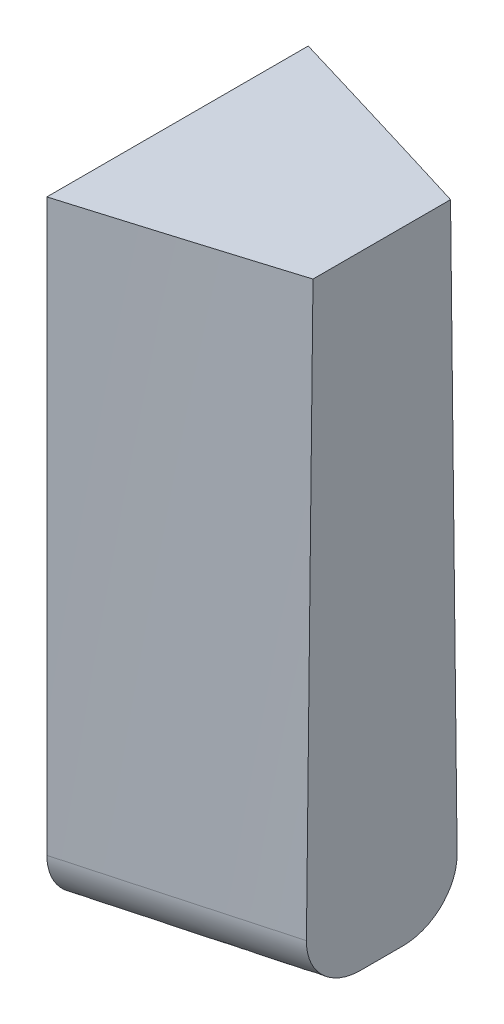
ISO-10303-21;
HEADER;
FILE_DESCRIPTION(('STEP AP214'),'2;1');
FILE_NAME('part.step','',(''),(''),'','','');
FILE_SCHEMA(('AUTOMOTIVE_DESIGN { 1 0 10303 214 1 1 1 1 }'));
ENDSEC;
DATA;
#1=APPLICATION_CONTEXT('core data for automotive mechanical design processes');
#2=APPLICATION_PROTOCOL_DEFINITION('international standard','automotive_design',2000,#1);
#3=PRODUCT_CONTEXT('',#1,'mechanical');
#4=PRODUCT('Part','Part','',(#3));
#5=PRODUCT_RELATED_PRODUCT_CATEGORY('part','',(#4));
#6=PRODUCT_DEFINITION_FORMATION('','',#4);
#7=PRODUCT_DEFINITION_CONTEXT('part definition',#1,'design');
#8=PRODUCT_DEFINITION('design','',#6,#7);
#9=PRODUCT_DEFINITION_SHAPE('','',#8);
#10=(LENGTH_UNIT() NAMED_UNIT(*) SI_UNIT(.MILLI.,.METRE.));
#11=(NAMED_UNIT(*) PLANE_ANGLE_UNIT() SI_UNIT($,.RADIAN.));
#12=(NAMED_UNIT(*) SI_UNIT($,.STERADIAN.) SOLID_ANGLE_UNIT());
#13=UNCERTAINTY_MEASURE_WITH_UNIT(LENGTH_MEASURE(1.E-05),#10,'distance_accuracy_value','');
#14=(GEOMETRIC_REPRESENTATION_CONTEXT(3) GLOBAL_UNCERTAINTY_ASSIGNED_CONTEXT((#13)) GLOBAL_UNIT_ASSIGNED_CONTEXT((#10,
#11,#12)) REPRESENTATION_CONTEXT('',''));
#15=CARTESIAN_POINT('',(0.,0.,0.));
#16=DIRECTION('',(0.,0.,1.));
#17=DIRECTION('',(1.,0.,0.));
#18=AXIS2_PLACEMENT_3D('',#15,#16,#17);
#19=CARTESIAN_POINT('',(35.0699557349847,9.10399609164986,-10.2042152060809));
#20=CARTESIAN_POINT('',(24.7263871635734,9.10399609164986,-13.389122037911));
#21=CARTESIAN_POINT('',(14.3682158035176,9.10399609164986,-16.5264355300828));
#22=CARTESIAN_POINT('',(4.00000000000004,9.10399609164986,-19.6301586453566));
#23=B_SPLINE_CURVE_WITH_KNOTS('',3,(#19,#20,#21,#22),.UNSPECIFIED.,.F.,.F.,(4,4),(0.,1.),.UNSPECIFIED.);
#24=DIRECTION('',(0.,1.,0.));
#25=VECTOR('',#24,1.);
#26=SURFACE_OF_LINEAR_EXTRUSION('',#23,#25);
#27=CARTESIAN_POINT('',(4.00000000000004,79.1039960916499,-19.6301586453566));
#28=CARTESIAN_POINT('',(14.3682158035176,79.1039960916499,-16.5264355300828));
#29=CARTESIAN_POINT('',(24.7263871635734,79.1039960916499,-13.389122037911));
#30=CARTESIAN_POINT('',(35.0699557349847,79.1039960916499,-10.2042152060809));
#31=B_SPLINE_CURVE_WITH_KNOTS('',3,(#27,#28,#29,#30),.UNSPECIFIED.,.F.,.F.,(4,4),(0.,1.),.UNSPECIFIED.);
#32=CARTESIAN_POINT('',(35.0699557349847,79.1039960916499,-10.2042152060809));
#33=VERTEX_POINT('',#32);
#34=CARTESIAN_POINT('',(4.00000000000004,79.1039960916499,-19.6301586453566));
#35=VERTEX_POINT('',#34);
#36=EDGE_CURVE('E157',#33,#35,#31,.F.);
#37=ORIENTED_EDGE('',*,*,#36,.F.);
#38=DIRECTION('',(0.,1.,0.));
#39=VECTOR('',#38,1.);
#40=CARTESIAN_POINT('',(35.0699557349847,9.10399609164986,-10.2042152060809));
#41=LINE('',#40,#39);
#42=CARTESIAN_POINT('',(35.0699557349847,9.10399609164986,-10.2042152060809));
#43=VERTEX_POINT('',#42);
#44=EDGE_CURVE('E12',#43,#33,#41,.T.);
#45=ORIENTED_EDGE('',*,*,#44,.F.);
#46=CARTESIAN_POINT('',(35.0699557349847,9.10399609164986,-10.2042152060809));
#47=CARTESIAN_POINT('',(24.7263871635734,9.10399609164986,-13.389122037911));
#48=CARTESIAN_POINT('',(14.3682158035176,9.10399609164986,-16.5264355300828));
#49=CARTESIAN_POINT('',(4.00000000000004,9.10399609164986,-19.6301586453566));
#50=B_SPLINE_CURVE_WITH_KNOTS('',3,(#46,#47,#48,#49),.UNSPECIFIED.,.F.,.F.,(4,4),(0.,1.),.UNSPECIFIED.);
#51=CARTESIAN_POINT('',(4.00000000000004,9.10399609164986,-19.6301586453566));
#52=VERTEX_POINT('',#51);
#53=EDGE_CURVE('E111',#43,#52,#50,.T.);
#54=ORIENTED_EDGE('',*,*,#53,.T.);
#55=DIRECTION('',(0.,1.,0.));
#56=VECTOR('',#55,1.);
#57=CARTESIAN_POINT('',(4.00000000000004,9.10399609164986,-19.6301586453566));
#58=LINE('',#57,#56);
#59=EDGE_CURVE('E90',#52,#35,#58,.T.);
#60=ORIENTED_EDGE('',*,*,#59,.T.);
#61=EDGE_LOOP('',(#37,#45,#54,#60));
#62=FACE_BOUND('',#61,.T.);
#63=ADVANCED_FACE('F44',(#62),#26,.T.);
#64=CARTESIAN_POINT('',(35.0699557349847,9.10399609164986,10.2042152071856));
#65=DIRECTION('',(1.,0.,0.));
#66=DIRECTION('',(0.,0.,-1.));
#67=AXIS2_PLACEMENT_3D('',#64,#65,#66);
#68=PLANE('',#67);
#69=DIRECTION('',(0.,0.,-1.));
#70=VECTOR('',#69,1.);
#71=CARTESIAN_POINT('',(35.0699557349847,79.1039960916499,10.2042152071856));
#72=LINE('',#71,#70);
#73=CARTESIAN_POINT('',(35.0699557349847,79.1039960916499,10.2042152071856));
#74=VERTEX_POINT('',#73);
#75=EDGE_CURVE('E113',#74,#33,#72,.T.);
#76=ORIENTED_EDGE('',*,*,#75,.F.);
#77=DIRECTION('',(0.,1.,0.));
#78=VECTOR('',#77,1.);
#79=CARTESIAN_POINT('',(35.0699557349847,9.10399609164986,10.2042152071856));
#80=LINE('',#79,#78);
#81=CARTESIAN_POINT('',(35.0699557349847,9.10399609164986,10.2042152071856));
#82=VERTEX_POINT('',#81);
#83=EDGE_CURVE('E56',#82,#74,#80,.T.);
#84=ORIENTED_EDGE('',*,*,#83,.F.);
#85=DIRECTION('',(0.,0.,-1.));
#86=VECTOR('',#85,1.);
#87=CARTESIAN_POINT('',(35.0699557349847,9.10399609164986,10.2042152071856));
#88=LINE('',#87,#86);
#89=EDGE_CURVE('E107',#82,#43,#88,.T.);
#90=ORIENTED_EDGE('',*,*,#89,.T.);
#91=ORIENTED_EDGE('',*,*,#44,.T.);
#92=EDGE_LOOP('',(#76,#84,#90,#91));
#93=FACE_BOUND('',#92,.T.);
#94=ADVANCED_FACE('F143',(#93),#68,.T.);
#95=CARTESIAN_POINT('',(4.00000000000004,9.10399609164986,19.630158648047));
#96=CARTESIAN_POINT('',(14.368216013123,9.10399609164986,16.5264354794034));
#97=CARTESIAN_POINT('',(24.7263869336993,9.10399609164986,13.3891221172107));
#98=CARTESIAN_POINT('',(35.0699557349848,9.10399609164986,10.2042152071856));
#99=B_SPLINE_CURVE_WITH_KNOTS('',3,(#95,#96,#97,#98),.UNSPECIFIED.,.F.,.F.,(4,4),(0.,1.),.UNSPECIFIED.);
#100=DIRECTION('',(0.,1.,0.));
#101=VECTOR('',#100,1.);
#102=SURFACE_OF_LINEAR_EXTRUSION('',#99,#101);
#103=CARTESIAN_POINT('',(35.0699557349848,79.1039960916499,10.2042152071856));
#104=CARTESIAN_POINT('',(24.7263869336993,79.1039960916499,13.3891221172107));
#105=CARTESIAN_POINT('',(14.368216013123,79.1039960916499,16.5264354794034));
#106=CARTESIAN_POINT('',(4.00000000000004,79.1039960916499,19.630158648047));
#107=B_SPLINE_CURVE_WITH_KNOTS('',3,(#103,#104,#105,#106),.UNSPECIFIED.,.F.,.F.,(4,4),(0.,1.),.UNSPECIFIED.);
#108=CARTESIAN_POINT('',(4.00000000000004,79.1039960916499,19.630158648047));
#109=VERTEX_POINT('',#108);
#110=EDGE_CURVE('E99',#109,#74,#107,.F.);
#111=ORIENTED_EDGE('',*,*,#110,.F.);
#112=DIRECTION('',(0.,1.,0.));
#113=VECTOR('',#112,1.);
#114=CARTESIAN_POINT('',(4.00000000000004,9.10399609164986,19.630158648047));
#115=LINE('',#114,#113);
#116=CARTESIAN_POINT('',(4.00000000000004,9.10399609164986,19.630158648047));
#117=VERTEX_POINT('',#116);
#118=EDGE_CURVE('E93',#117,#109,#115,.T.);
#119=ORIENTED_EDGE('',*,*,#118,.F.);
#120=CARTESIAN_POINT('',(4.00000000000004,9.10399609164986,19.630158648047));
#121=CARTESIAN_POINT('',(14.368216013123,9.10399609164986,16.5264354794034));
#122=CARTESIAN_POINT('',(24.7263869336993,9.10399609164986,13.3891221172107));
#123=CARTESIAN_POINT('',(35.0699557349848,9.10399609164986,10.2042152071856));
#124=B_SPLINE_CURVE_WITH_KNOTS('',3,(#120,#121,#122,#123),.UNSPECIFIED.,.F.,.F.,(4,4),(0.,1.),.UNSPECIFIED.);
#125=EDGE_CURVE('E96',#117,#82,#124,.T.);
#126=ORIENTED_EDGE('',*,*,#125,.T.);
#127=ORIENTED_EDGE('',*,*,#83,.T.);
#128=EDGE_LOOP('',(#111,#119,#126,#127));
#129=FACE_BOUND('',#128,.T.);
#130=ADVANCED_FACE('F95',(#129),#102,.T.);
#131=CARTESIAN_POINT('',(4.00000000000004,9.10399609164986,-19.6301586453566));
#132=DIRECTION('',(-1.,0.,0.));
#133=DIRECTION('',(0.,0.,1.));
#134=AXIS2_PLACEMENT_3D('',#131,#132,#133);
#135=PLANE('',#134);
#136=DIRECTION('',(0.,0.,1.));
#137=VECTOR('',#136,1.);
#138=CARTESIAN_POINT('',(4.00000000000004,79.1039960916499,-19.6301586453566));
#139=LINE('',#138,#137);
#140=EDGE_CURVE('E158',#35,#109,#139,.T.);
#141=ORIENTED_EDGE('',*,*,#140,.F.);
#142=ORIENTED_EDGE('',*,*,#59,.F.);
#143=DIRECTION('',(0.,0.,1.));
#144=VECTOR('',#143,1.);
#145=CARTESIAN_POINT('',(4.00000000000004,9.10399609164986,-19.6301586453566));
#146=LINE('',#145,#144);
#147=EDGE_CURVE('E106',#52,#117,#146,.T.);
#148=ORIENTED_EDGE('',*,*,#147,.T.);
#149=ORIENTED_EDGE('',*,*,#118,.T.);
#150=EDGE_LOOP('',(#141,#142,#148,#149));
#151=FACE_BOUND('',#150,.T.);
#152=ADVANCED_FACE('F110',(#151),#135,.T.);
#153=CARTESIAN_POINT('',(19.5442205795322,9.10399609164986,-14.9476308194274));
#154=DIRECTION('',(0.,-1.,0.));
#155=DIRECTION('',(0.,0.,-1.));
#156=AXIS2_PLACEMENT_3D('',#153,#154,#155);
#157=PLANE('',#156);
#158=ORIENTED_EDGE('',*,*,#53,.F.);
#159=ORIENTED_EDGE('',*,*,#89,.F.);
#160=ORIENTED_EDGE('',*,*,#125,.F.);
#161=ORIENTED_EDGE('',*,*,#147,.F.);
#162=EDGE_LOOP('',(#158,#159,#160,#161));
#163=FACE_BOUND('',#162,.T.);
#164=ADVANCED_FACE('F105',(#163),#157,.T.);
#165=CARTESIAN_POINT('',(19.5442205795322,79.1039960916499,-14.9476308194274));
#166=DIRECTION('',(0.,-1.,0.));
#167=DIRECTION('',(0.,0.,-1.));
#168=AXIS2_PLACEMENT_3D('',#165,#166,#167);
#169=PLANE('',#168);
#170=ORIENTED_EDGE('',*,*,#36,.T.);
#171=ORIENTED_EDGE('',*,*,#140,.T.);
#172=ORIENTED_EDGE('',*,*,#110,.T.);
#173=ORIENTED_EDGE('',*,*,#75,.T.);
#174=EDGE_LOOP('',(#170,#171,#172,#173));
#175=FACE_BOUND('',#174,.T.);
#176=ADVANCED_FACE('F132',(#175),#169,.F.);
#177=CLOSED_SHELL('',(#63,#94,#130,#152,#164,#176));
#178=MANIFOLD_SOLID_BREP('B2',#177);
#179=CARTESIAN_POINT('',(0.,119.10399609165,-25.570067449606));
#180=DIRECTION('',(0.,-1.,0.));
#181=DIRECTION('',(0.,0.,-1.));
#182=AXIS2_PLACEMENT_3D('',#179,#180,#181);
#183=PLANE('',#182);
#184=CARTESIAN_POINT('',(39.0699557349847,119.10399609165,-13.1565904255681));
#185=CARTESIAN_POINT('',(37.215246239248,119.10399609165,-13.7293949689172));
#186=CARTESIAN_POINT('',(35.3600451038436,119.10399609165,-14.3006063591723));
#187=CARTESIAN_POINT('',(31.6487247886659,119.10399609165,-15.4400346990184));
#188=CARTESIAN_POINT('',(29.7926056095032,119.10399609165,-16.008251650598));
#189=CARTESIAN_POINT('',(26.079512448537,119.10399609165,-17.1418835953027));
#190=CARTESIAN_POINT('',(24.2225384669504,119.10399609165,-17.7072985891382));
#191=CARTESIAN_POINT('',(20.5077910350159,119.10399609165,-18.8354985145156));
#192=CARTESIAN_POINT('',(18.6500175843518,119.10399609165,-19.3982834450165));
#193=CARTESIAN_POINT('',(13.994811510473,119.10399609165,-20.8051346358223));
#194=CARTESIAN_POINT('',(11.1969067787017,119.10399609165,-21.6476387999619));
#195=CARTESIAN_POINT('',(5.59956452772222,119.10399609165,-23.3275341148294));
#196=CARTESIAN_POINT('',(2.80012700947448,119.10399609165,-24.1649252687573));
#197=CARTESIAN_POINT('',(0.,119.10399609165,-25.));
#198=B_SPLINE_CURVE_WITH_KNOTS('',3,(#184,#185,#186,#187,#188,#189,#190,#191,#192,#193,#194,
#195,#196,#197),.UNSPECIFIED.,.F.,.F.,(4,2,2,2,2,2,4),(0.,5.82344027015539,11.6468766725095,
17.4703115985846,23.2937488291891,32.0597435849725,40.8257328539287),.UNSPECIFIED.);
#199=CARTESIAN_POINT('',(39.0699557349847,119.10399609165,-13.1565904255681));
#200=VERTEX_POINT('',#199);
#201=CARTESIAN_POINT('',(0.,119.10399609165,-25.));
#202=VERTEX_POINT('',#201);
#203=EDGE_CURVE('E277',#200,#202,#198,.T.);
#204=ORIENTED_EDGE('',*,*,#203,.T.);
#205=DIRECTION('',(0.,0.,1.));
#206=VECTOR('',#205,1.);
#207=CARTESIAN_POINT('',(0.,119.10399609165,25.));
#208=LINE('',#207,#206);
#209=CARTESIAN_POINT('',(0.,119.10399609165,25.));
#210=VERTEX_POINT('',#209);
#211=EDGE_CURVE('E443',#202,#210,#208,.T.);
#212=ORIENTED_EDGE('',*,*,#211,.T.);
#213=CARTESIAN_POINT('',(0.,119.10399609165,25.));
#214=CARTESIAN_POINT('',(1.86018533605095,119.10399609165,24.4452471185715));
#215=CARTESIAN_POINT('',(3.72006445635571,119.10399609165,23.889466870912));
#216=CARTESIAN_POINT('',(7.43916829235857,119.10399609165,22.7757182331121));
#217=CARTESIAN_POINT('',(9.29839300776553,119.10399609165,22.2177498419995));
#218=CARTESIAN_POINT('',(13.01614463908,119.10399609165,21.0994919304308));
#219=CARTESIAN_POINT('',(14.8746715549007,119.10399609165,20.5392024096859));
#220=CARTESIAN_POINT('',(18.5909786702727,119.10399609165,19.416154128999));
#221=CARTESIAN_POINT('',(20.4487588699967,119.10399609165,18.8533953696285));
#222=CARTESIAN_POINT('',(25.1020502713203,119.10399609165,17.4402300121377));
#223=CARTESIAN_POINT('',(27.8970572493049,119.10399609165,16.5881619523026));
#224=CARTESIAN_POINT('',(33.4850641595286,119.10399609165,14.8774572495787));
#225=CARTESIAN_POINT('',(36.2780640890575,119.10399609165,14.0188205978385));
#226=CARTESIAN_POINT('',(39.0699557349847,119.10399609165,13.1565904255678));
#227=B_SPLINE_CURVE_WITH_KNOTS('',3,(#213,#214,#215,#216,#217,#218,#219,#220,#221,#222,#223,
#224,#225,#226),.UNSPECIFIED.,.F.,.F.,(4,2,2,2,2,2,4),(0.,5.82343210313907,11.6468667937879,
17.4703022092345,23.2937362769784,32.0597282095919,40.825731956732),.UNSPECIFIED.);
#228=CARTESIAN_POINT('',(39.0699557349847,119.10399609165,13.1565904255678));
#229=VERTEX_POINT('',#228);
#230=EDGE_CURVE('E286',#210,#229,#227,.T.);
#231=ORIENTED_EDGE('',*,*,#230,.T.);
#232=DIRECTION('',(0.,0.,-1.));
#233=VECTOR('',#232,1.);
#234=CARTESIAN_POINT('',(39.0699557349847,119.10399609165,-12.9422863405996));
#235=LINE('',#234,#233);
#236=EDGE_CURVE('E42',#229,#200,#235,.T.);
#237=ORIENTED_EDGE('',*,*,#236,.T.);
#238=EDGE_LOOP('',(#204,#212,#231,#237));
#239=FACE_BOUND('',#238,.T.);
#240=ADVANCED_FACE('F273',(#239),#183,.F.);
#241=CARTESIAN_POINT('',(0.,0.,0.));
#242=DIRECTION('',(0.,-1.,0.));
#243=DIRECTION('',(0.,0.,-1.));
#244=AXIS2_PLACEMENT_3D('',#241,#242,#243);
#245=PLANE('',#244);
#246=DIRECTION('',(0.,0.,1.));
#247=VECTOR('',#246,1.);
#248=CARTESIAN_POINT('',(0.,0.,0.));
#249=LINE('',#248,#247);
#250=CARTESIAN_POINT('',(0.,0.,-14.6405656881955));
#251=VERTEX_POINT('',#250);
#252=CARTESIAN_POINT('',(0.,0.,0.));
#253=VERTEX_POINT('',#252);
#254=EDGE_CURVE('E332',#251,#253,#249,.T.);
#255=ORIENTED_EDGE('',*,*,#254,.F.);
#256=CARTESIAN_POINT('',(50.8113989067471,0.,-0.863214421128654));
#257=CARTESIAN_POINT('',(53.4779346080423,0.,-10.6704602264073));
#258=CARTESIAN_POINT('',(53.4347479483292,10.1619579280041,-10.5116241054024));
#259=CARTESIAN_POINT('',(48.4180896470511,0.,-1.51392327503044));
#260=CARTESIAN_POINT('',(51.0823465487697,0.,-11.3123693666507));
#261=CARTESIAN_POINT('',(51.0406989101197,10.1530122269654,-11.1626828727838));
#262=CARTESIAN_POINT('',(46.0247087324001,0.,-2.16436835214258));
#263=CARTESIAN_POINT('',(48.6859293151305,0.,-11.9544997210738));
#264=CARTESIAN_POINT('',(48.6466083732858,10.1443244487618,-11.8134548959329));
#265=CARTESIAN_POINT('',(41.2378035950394,0.,-3.46473095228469));
#266=CARTESIAN_POINT('',(43.893294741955,0.,-13.2387049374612));
#267=CARTESIAN_POINT('',(43.8583443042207,10.1274647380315,-13.1144254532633));
#268=CARTESIAN_POINT('',(38.8442793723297,0.,-4.11464847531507));
#269=CARTESIAN_POINT('',(41.4969493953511,0.,-13.8808141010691));
#270=CARTESIAN_POINT('',(41.4641707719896,10.1192928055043,-13.7646239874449));
#271=CARTESIAN_POINT('',(36.4506834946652,0.,-4.76430222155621));
#272=CARTESIAN_POINT('',(39.0994574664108,0.,-14.5232295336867));
#273=CARTESIAN_POINT('',(39.0699557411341,10.1113787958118,-14.4145357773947));
#274=CARTESIAN_POINT('',(35.5911728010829,0.,-4.99759092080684));
#275=CARTESIAN_POINT('',(38.2390800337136,0.,-14.7537703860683));
#276=CARTESIAN_POINT('',(38.2102218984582,10.1085316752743,-14.6479178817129));
#277=CARTESIAN_POINT('',(34.7316537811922,0.,-5.23084894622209));
#278=CARTESIAN_POINT('',(37.3785829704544,0.,-14.9843431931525));
#279=CARTESIAN_POINT('',(37.3504831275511,10.1057146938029,-14.8812668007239));
#280=CARTESIAN_POINT('',(28.2253237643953,0.,-6.99630775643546));
#281=CARTESIAN_POINT('',(30.8700737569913,0.,-16.7283173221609));
#282=CARTESIAN_POINT('',(30.8425144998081,10.084613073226,-16.6473954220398));
#283=CARTESIAN_POINT('',(22.578171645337,0.,-8.5272515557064));
#284=CARTESIAN_POINT('',(25.2164299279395,0.,-18.2432236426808));
#285=CARTESIAN_POINT('',(25.1940818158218,10.0675647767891,-18.178816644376));
#286=CARTESIAN_POINT('',(13.1657851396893,0.,-11.0770848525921));
#287=CARTESIAN_POINT('',(15.7924808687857,0.,-20.7683870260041));
#288=CARTESIAN_POINT('',(15.7797412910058,10.0408755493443,-20.7293216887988));
#289=CARTESIAN_POINT('',(9.40070770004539,0.,-12.0965538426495));
#290=CARTESIAN_POINT('',(12.0238216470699,0.,-21.7782045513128));
#291=CARTESIAN_POINT('',(12.0139303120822,10.0306597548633,-21.7490263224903));
#292=CARTESIAN_POINT('',(2.88671140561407,0.,-13.8595878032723));
#293=CARTESIAN_POINT('',(5.50329823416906,0.,-23.5253863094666));
#294=CARTESIAN_POINT('',(5.49873589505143,10.0136905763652,-23.5124211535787));
#295=CARTESIAN_POINT('',(0.137844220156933,0.,-14.603343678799));
#296=CARTESIAN_POINT('',(2.75206196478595,0.,-24.2625827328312));
#297=CARTESIAN_POINT('',(2.74938497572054,10.0067469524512,-24.2563148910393));
#298=CARTESIAN_POINT('',(-2.61107612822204,0.,-15.3469030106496));
#299=CARTESIAN_POINT('',(1.14191772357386E-09,0.,-24.99999999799));
#300=CARTESIAN_POINT('',(1.57067553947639E-09,10.0000000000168,-24.9999999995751));
#301=CARTESIAN_POINT('',(-3.62749763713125,0.,-15.6218355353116));
#302=CARTESIAN_POINT('',(-1.01712231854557,0.,-25.2725387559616));
#303=CARTESIAN_POINT('',(-1.01659319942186,9.99750595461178,-25.2749789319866));
#304=CARTESIAN_POINT('',(-4.6439263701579,0.,-15.8967413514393));
#305=CARTESIAN_POINT('',(-2.03436568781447,0.,-25.5451098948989));
#306=CARTESIAN_POINT('',(-2.03319103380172,9.99503864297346,-25.5499295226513));
#307=CARTESIAN_POINT('',(-13.1911527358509,0.,-18.2082105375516));
#308=CARTESIAN_POINT('',(-10.5816295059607,0.,-27.8353553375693));
#309=CARTESIAN_POINT('',(-10.5818182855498,9.97451003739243,-27.8617620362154));
#310=CARTESIAN_POINT('',(-20.7223294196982,0.,-20.2433723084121));
#311=CARTESIAN_POINT('',(-18.1191109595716,0.,-29.8550260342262));
#312=CARTESIAN_POINT('',(-18.1140915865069,9.95785271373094,-29.8971578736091));
#313=CARTESIAN_POINT('',(-35.7853002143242,0.,-24.3114115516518));
#314=CARTESIAN_POINT('',(-33.1923003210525,0.,-33.893888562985));
#315=CARTESIAN_POINT('',(-33.1790475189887,9.9268425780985,-33.9655464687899));
#316=CARTESIAN_POINT('',(-43.3170943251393,0.,-26.3442890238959));
#317=CARTESIAN_POINT('',(-40.7297625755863,0.,-35.9135504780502));
#318=CARTESIAN_POINT('',(-40.7117301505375,9.91248976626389,-35.9985392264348));
#319=CARTESIAN_POINT('',(-50.8491193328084,0.,-28.3763096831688));
#320=CARTESIAN_POINT('',(-48.2706132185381,0.,-37.9341195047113));
#321=CARTESIAN_POINT('',(-48.2445732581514,9.89901144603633,-38.0306424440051));
#322=(BOUNDED_SURFACE() B_SPLINE_SURFACE(3,2,((#256,#257,#258),(#259,#260,#261),(#262,#263,
#264),(#265,#266,#267),(#268,#269,#270),(#271,#272,#273),(#274,#275,#276),(#277,#278,#279),
(#280,#281,#282),(#283,#284,#285),(#286,#287,#288),(#289,#290,#291),(#292,#293,#294),(#295,#296,
#297),(#298,#299,#300),(#301,#302,#303),(#304,#305,#306),(#307,#308,#309),(#310,#311,#312),
(#313,#314,#315),(#316,#317,#318),(#319,#320,#321)),.UNSPECIFIED.,.F.,.F.,
.F.) B_SPLINE_SURFACE_WITH_KNOTS((4,2,3,2,2,2,3,2,2,4),(3,3),(0.,7.44057517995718,
14.8811503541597,17.5529737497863,35.1059513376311,46.8079223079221,55.3510477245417,
58.509893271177,81.9138358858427,105.317779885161),(0.,1.),
.UNSPECIFIED.) GEOMETRIC_REPRESENTATION_ITEM() RATIONAL_B_SPLINE_SURFACE(((1.,0.701357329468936,
1.),(1.,0.701676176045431,1.),(1.,0.701985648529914,1.),(1.,0.702585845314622,1.),(1.,
0.702876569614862,1.),(1.,0.703157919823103,1.),(1.,0.703259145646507,1.),(1.,0.70335927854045,
1.),(1.,0.70410920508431,1.),(1.,0.70471418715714,1.),(1.,0.705660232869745,1.),(1.,
0.706022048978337,1.),(1.,0.706622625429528,1.),(1.,0.70686823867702,1.),(1.,0.707106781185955,
1.),(1.,0.707194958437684,1.),(1.,0.707282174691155,1.),(1.,0.708007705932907,1.),(1.,
0.708595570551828,1.),(1.,0.709688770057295,1.),(1.,0.710194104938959,1.),(1.,0.710668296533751,1.))) REPRESENTATION_ITEM('') SURFACE());
#323=CARTESIAN_POINT('',(-50.8491193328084,0.,-28.3763096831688));
#324=CARTESIAN_POINT('',(-43.3170943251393,0.,-26.3442890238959));
#325=CARTESIAN_POINT('',(-35.7853002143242,0.,-24.3114115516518));
#326=CARTESIAN_POINT('',(-20.7223294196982,0.,-20.2433723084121));
#327=CARTESIAN_POINT('',(-13.1911527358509,0.,-18.2082105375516));
#328=CARTESIAN_POINT('',(-4.6439263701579,0.,-15.8967413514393));
#329=CARTESIAN_POINT('',(-3.62749763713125,0.,-15.6218355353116));
#330=CARTESIAN_POINT('',(-2.61107612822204,0.,-15.3469030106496));
#331=CARTESIAN_POINT('',(0.137844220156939,0.,-14.603343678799));
#332=CARTESIAN_POINT('',(2.88671140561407,0.,-13.8595878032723));
#333=CARTESIAN_POINT('',(9.40070770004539,0.,-12.0965538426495));
#334=CARTESIAN_POINT('',(13.1657851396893,0.,-11.0770848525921));
#335=CARTESIAN_POINT('',(22.578171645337,0.,-8.5272515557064));
#336=CARTESIAN_POINT('',(28.2253237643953,0.,-6.99630775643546));
#337=CARTESIAN_POINT('',(34.7316537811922,0.,-5.23084894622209));
#338=CARTESIAN_POINT('',(35.5911728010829,0.,-4.99759092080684));
#339=CARTESIAN_POINT('',(36.4506834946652,0.,-4.76430222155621));
#340=CARTESIAN_POINT('',(38.8442793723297,0.,-4.11464847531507));
#341=CARTESIAN_POINT('',(41.2378035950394,0.,-3.46473095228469));
#342=CARTESIAN_POINT('',(46.0247087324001,0.,-2.16436835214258));
#343=CARTESIAN_POINT('',(48.4180896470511,0.,-1.51392327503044));
#344=CARTESIAN_POINT('',(50.8113989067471,0.,-0.863214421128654));
#345=B_SPLINE_CURVE_WITH_KNOTS('',3,(#323,#324,#325,#326,#327,#328,#329,#330,#331,#332,#333,
#334,#335,#336,#337,#338,#339,#340,#341,#342,#343,#344),.UNSPECIFIED.,.F.,.F.,(4,2,2,3,2,2,2,3,
2,4),(0.,23.4039439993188,46.8078866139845,49.9667321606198,58.5098575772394,70.2118285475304,
87.7648061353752,90.4366295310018,97.8772047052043,105.317779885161),.UNSPECIFIED.);
#346=CARTESIAN_POINT('',(39.0699557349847,0.,-4.05327379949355));
#347=VERTEX_POINT('',#346);
#348=EDGE_CURVE('E413',#251,#347,#345,.T.);
#349=ORIENTED_EDGE('',*,*,#348,.T.);
#350=DIRECTION('',(0.,0.,-1.));
#351=VECTOR('',#350,1.);
#352=CARTESIAN_POINT('',(39.0699557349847,0.,-14.531236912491));
#353=LINE('',#352,#351);
#354=CARTESIAN_POINT('',(39.0699557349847,0.,4.05327379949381));
#355=VERTEX_POINT('',#354);
#356=EDGE_CURVE('E344',#355,#347,#353,.T.);
#357=ORIENTED_EDGE('',*,*,#356,.F.);
#358=CARTESIAN_POINT('',(-16.974044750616,0.,19.2301171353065));
#359=CARTESIAN_POINT('',(-14.3739480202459,0.,28.8515077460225));
#360=CARTESIAN_POINT('',(-14.3652301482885,9.96647097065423,28.8837673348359));
#361=CARTESIAN_POINT('',(-14.5801413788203,0.,18.5831931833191));
#362=CARTESIAN_POINT('',(-11.9775843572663,0.,28.2094012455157));
#363=CARTESIAN_POINT('',(-11.9709764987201,9.97177999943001,28.2367676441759));
#364=CARTESIAN_POINT('',(-12.186275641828,0.,17.9361300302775));
#365=CARTESIAN_POINT('',(-9.58195815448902,0.,27.5674920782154));
#366=CARTESIAN_POINT('',(-9.57674716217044,9.97722859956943,27.589620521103));
#367=CARTESIAN_POINT('',(-7.39861943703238,0.,16.641725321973));
#368=CARTESIAN_POINT('',(-4.79074361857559,0.,26.2836833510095));
#369=CARTESIAN_POINT('',(-4.78833711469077,9.98840494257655,26.2950314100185));
#370=CARTESIAN_POINT('',(-5.0048289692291,0.,15.99438376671));
#371=CARTESIAN_POINT('',(-2.39508739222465,0.,25.6417655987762));
#372=CARTESIAN_POINT('',(-2.39415640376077,9.99413268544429,25.6475894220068));
#373=CARTESIAN_POINT('',(-2.61107613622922,0.,15.3469030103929));
#374=CARTESIAN_POINT('',(-6.97790826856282E-09,0.,24.9999999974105));
#375=CARTESIAN_POINT('',(-5.84949012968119E-09,9.99999999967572,25.0000000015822));
#376=CARTESIAN_POINT('',(-1.74769593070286,0.,15.1133662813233));
#377=CARTESIAN_POINT('',(0.864169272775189,0.,24.7684451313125));
#378=CARTESIAN_POINT('',(0.863526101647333,10.0021189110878,24.7664237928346));
#379=CARTESIAN_POINT('',(-0.884320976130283,0.,14.8798101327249));
#380=CARTESIAN_POINT('',(1.72825294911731,0.,24.536913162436));
#381=CARTESIAN_POINT('',(1.72704884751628,10.004257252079,24.5328269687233));
#382=CARTESIAN_POINT('',(5.62986079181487,0.,13.1174616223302));
#383=CARTESIAN_POINT('',(8.2517400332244,0.,22.7889388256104));
#384=CARTESIAN_POINT('',(8.2423606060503,10.0205425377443,22.7701619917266));
#385=CARTESIAN_POINT('',(11.2804404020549,0.,11.5878292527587));
#386=CARTESIAN_POINT('',(13.9078677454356,0.,21.2733723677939));
#387=CARTESIAN_POINT('',(13.8940050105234,10.0355287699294,21.2402007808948));
#388=CARTESIAN_POINT('',(20.6976006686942,0.,9.03670115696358));
#389=CARTESIAN_POINT('',(23.3315196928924,0.,18.7482885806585));
#390=CARTESIAN_POINT('',(23.3131205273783,10.0622328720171,18.6884003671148));
#391=CARTESIAN_POINT('',(24.4643385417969,0.,8.01578577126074));
#392=CARTESIAN_POINT('',(27.1022502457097,0.,17.7379136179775));
#393=CARTESIAN_POINT('',(27.0806886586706,10.0733750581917,17.6671829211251));
#394=CARTESIAN_POINT('',(30.9709279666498,0.,6.25128317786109));
#395=CARTESIAN_POINT('',(33.6146955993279,0.,15.9928877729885));
#396=CARTESIAN_POINT('',(33.5888123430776,10.0935350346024,15.9020864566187));
#397=CARTESIAN_POINT('',(33.710847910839,0.,5.50794815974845));
#398=CARTESIAN_POINT('',(36.3577096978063,0.,15.2578895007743));
#399=CARTESIAN_POINT('',(36.3294090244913,10.1023041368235,15.1584792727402));
#400=CARTESIAN_POINT('',(36.4506834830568,0.,4.7643022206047));
#401=CARTESIAN_POINT('',(39.0994574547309,0.,14.5232295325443));
#402=CARTESIAN_POINT('',(39.0699557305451,10.1113787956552,14.4145357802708));
#403=CARTESIAN_POINT('',(37.4772184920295,0.,4.48567867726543));
#404=CARTESIAN_POINT('',(40.1273416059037,0.,14.2478047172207));
#405=CARTESIAN_POINT('',(40.0967574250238,10.1147800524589,14.1358005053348));
#406=CARTESIAN_POINT('',(38.5037417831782,0.,4.20701191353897));
#407=CARTESIAN_POINT('',(41.155069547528,0.,13.9724216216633));
#408=CARTESIAN_POINT('',(41.1235521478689,10.1182238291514,13.8570185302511));
#409=CARTESIAN_POINT('',(47.0628171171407,0.,1.88310188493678));
#410=CARTESIAN_POINT('',(49.7339458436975,0.,11.6736821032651));
#411=CARTESIAN_POINT('',(49.6849331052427,10.147310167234,11.5321162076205));
#412=CARTESIAN_POINT('',(54.5947170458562,0.,-0.164544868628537));
#413=CARTESIAN_POINT('',(57.277964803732,0.,9.65222785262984));
#414=CARTESIAN_POINT('',(57.2191360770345,10.1753107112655,9.48339171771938));
#415=CARTESIAN_POINT('',(65.8912029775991,0.,-3.24102833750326));
#416=CARTESIAN_POINT('',(68.5823972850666,0.,6.6231309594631));
#417=CARTESIAN_POINT('',(68.5196897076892,10.2221597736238,6.40479699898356));
#418=CARTESIAN_POINT('',(69.6564716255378,0.,-4.26735856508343));
#419=CARTESIAN_POINT('',(72.3540695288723,0.,5.61248281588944));
#420=CARTESIAN_POINT('',(72.2864164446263,10.2385841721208,5.37768058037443));
#421=CARTESIAN_POINT('',(77.1864627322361,0.,-6.32202163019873));
#422=CARTESIAN_POINT('',(79.8969141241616,0.,3.59130960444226));
#423=CARTESIAN_POINT('',(79.8195826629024,10.2733508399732,3.32122769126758));
#424=CARTESIAN_POINT('',(80.9511851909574,0.,-7.35035446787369));
#425=CARTESIAN_POINT('',(83.6688474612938,0.,2.58058060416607));
#426=CARTESIAN_POINT('',(83.5860221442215,10.2916931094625,2.29189122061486));
#427=CARTESIAN_POINT('',(84.7155887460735,0.,-8.3798543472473));
#428=CARTESIAN_POINT('',(87.4369740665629,0.,1.57086455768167));
#429=CARTESIAN_POINT('',(87.3522994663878,10.3111452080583,1.26125270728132));
#430=(BOUNDED_SURFACE() B_SPLINE_SURFACE(3,2,((#358,#359,#360),(#361,#362,#363),(#364,#365,
#366),(#367,#368,#369),(#370,#371,#372),(#373,#374,#375),(#376,#377,#378),(#379,#380,#381),
(#382,#383,#384),(#385,#386,#387),(#388,#389,#390),(#391,#392,#393),(#394,#395,#396),(#397,#398,
#399),(#400,#401,#402),(#403,#404,#405),(#406,#407,#408),(#409,#410,#411),(#412,#413,#414),
(#415,#416,#417),(#418,#419,#420),(#421,#422,#423),(#424,#425,#426),(#427,#428,#429)),
.UNSPECIFIED.,.F.,.F.,.F.) B_SPLINE_SURFACE_WITH_KNOTS((4,2,3,2,2,2,3,2,2,2,4),(3,3),(0.,
7.43932490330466,14.8786498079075,17.5618723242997,35.1237461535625,46.8316596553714,
55.348547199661,58.5395732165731,81.9554061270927,93.6633267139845,105.371248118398),(0.,1.),
.UNSPECIFIED.) GEOMETRIC_REPRESENTATION_ITEM() RATIONAL_B_SPLINE_SURFACE(((1.,0.708291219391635,
1.),(1.,0.708103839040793,1.),(1.,0.707911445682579,1.),(1.,0.707516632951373,1.),(1.,
0.70731421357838,1.),(1.,0.707106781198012,1.),(1.,0.707031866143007,1.),(1.,0.706956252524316,
1.),(1.,0.706380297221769,1.),(1.,0.705849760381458,1.),(1.,0.704903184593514,1.),(1.,
0.704507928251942,1.),(1.,0.703792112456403,1.),(1.,0.703480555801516,1.),(1.,0.703157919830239,
1.),(1.,0.70303699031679,1.),(1.,0.702914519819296,1.),(1.,0.701879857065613,1.),(1.,
0.700882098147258,1.),(1.,0.699208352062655,1.),(1.,0.698620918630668,1.),(1.,0.697375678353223,
1.),(1.,0.696717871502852,1.),(1.,0.696019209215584,1.))) REPRESENTATION_ITEM('') SURFACE());
#431=CARTESIAN_POINT('',(84.7155887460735,0.,-8.3798543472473));
#432=CARTESIAN_POINT('',(80.9511851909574,0.,-7.35035446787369));
#433=CARTESIAN_POINT('',(77.1864627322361,0.,-6.32202163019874));
#434=CARTESIAN_POINT('',(69.6564716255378,0.,-4.26735856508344));
#435=CARTESIAN_POINT('',(65.8912029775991,0.,-3.24102833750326));
#436=CARTESIAN_POINT('',(54.5947170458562,0.,-0.164544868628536));
#437=CARTESIAN_POINT('',(47.0628171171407,0.,1.88310188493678));
#438=CARTESIAN_POINT('',(38.5037417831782,0.,4.20701191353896));
#439=CARTESIAN_POINT('',(37.4772184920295,0.,4.48567867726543));
#440=CARTESIAN_POINT('',(36.4506834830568,0.,4.7643022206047));
#441=CARTESIAN_POINT('',(33.710847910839,0.,5.50794815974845));
#442=CARTESIAN_POINT('',(30.9709279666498,0.,6.25128317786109));
#443=CARTESIAN_POINT('',(24.4643385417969,0.,8.01578577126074));
#444=CARTESIAN_POINT('',(20.6976006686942,0.,9.03670115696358));
#445=CARTESIAN_POINT('',(11.2804404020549,0.,11.5878292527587));
#446=CARTESIAN_POINT('',(5.62986079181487,0.,13.1174616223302));
#447=CARTESIAN_POINT('',(-0.884320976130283,0.,14.8798101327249));
#448=CARTESIAN_POINT('',(-1.74769593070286,0.,15.1133662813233));
#449=CARTESIAN_POINT('',(-2.61107613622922,0.,15.3469030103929));
#450=CARTESIAN_POINT('',(-5.0048289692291,0.,15.99438376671));
#451=CARTESIAN_POINT('',(-7.39861943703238,0.,16.641725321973));
#452=CARTESIAN_POINT('',(-12.186275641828,0.,17.9361300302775));
#453=CARTESIAN_POINT('',(-14.5801413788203,0.,18.5831931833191));
#454=CARTESIAN_POINT('',(-16.974044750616,0.,19.2301171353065));
#455=B_SPLINE_CURVE_WITH_KNOTS('',3,(#431,#432,#433,#434,#435,#436,#437,#438,#439,#440,#441,
#442,#443,#444,#445,#446,#447,#448,#449,#450,#451,#452,#453,#454),.UNSPECIFIED.,.F.,.F.,(4,2,2,
2,3,2,2,2,3,2,4),(0.,11.7079214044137,23.4158419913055,46.8316749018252,50.0227009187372,
58.5395884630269,70.2475019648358,87.8093757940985,90.4925983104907,97.9319232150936,
105.371248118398),.UNSPECIFIED.);
#456=CARTESIAN_POINT('',(0.,0.,14.6405656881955));
#457=VERTEX_POINT('',#456);
#458=EDGE_CURVE('E353',#355,#457,#455,.T.);
#459=ORIENTED_EDGE('',*,*,#458,.T.);
#460=DIRECTION('',(0.,0.,1.));
#461=VECTOR('',#460,1.);
#462=CARTESIAN_POINT('',(0.,0.,0.));
#463=LINE('',#462,#461);
#464=EDGE_CURVE('E336',#253,#457,#463,.T.);
#465=ORIENTED_EDGE('',*,*,#464,.F.);
#466=EDGE_LOOP('',(#255,#349,#357,#459,#465));
#467=FACE_BOUND('',#466,.T.);
#468=ADVANCED_FACE('F350',(#467),#245,.T.);
#469=CARTESIAN_POINT('',(0.,160.,25.));
#470=DIRECTION('',(-1.,0.,0.));
#471=DIRECTION('',(0.,0.,-1.));
#472=AXIS2_PLACEMENT_3D('',#469,#470,#471);
#473=PLANE('',#472);
#474=ORIENTED_EDGE('',*,*,#211,.F.);
#475=DIRECTION('',(0.,-1.,0.));
#476=VECTOR('',#475,1.);
#477=CARTESIAN_POINT('',(0.,80.,-25.));
#478=LINE('',#477,#476);
#479=CARTESIAN_POINT('',(0.,10.,-25.));
#480=VERTEX_POINT('',#479);
#481=EDGE_CURVE('E480',#202,#480,#478,.T.);
#482=ORIENTED_EDGE('',*,*,#481,.T.);
#483=CARTESIAN_POINT('',(0.,10.,-25.));
#484=CARTESIAN_POINT('',(0.,9.72580380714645,-25.0000362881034));
#485=CARTESIAN_POINT('',(0.,9.45161553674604,-24.9883187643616));
#486=CARTESIAN_POINT('',(0.,8.90525591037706,-24.9416404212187));
#487=CARTESIAN_POINT('',(0.,8.63308432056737,-24.9066823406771));
#488=CARTESIAN_POINT('',(0.,8.09315570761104,-24.8138665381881));
#489=CARTESIAN_POINT('',(0.,7.82539193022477,-24.7560480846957));
#490=CARTESIAN_POINT('',(0.,7.29570245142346,-24.618017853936));
#491=CARTESIAN_POINT('',(0.,7.03377675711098,-24.5378060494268));
#492=CARTESIAN_POINT('',(0.,6.51756592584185,-24.3556540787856));
#493=CARTESIAN_POINT('',(0.,6.26328158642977,-24.2537116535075));
#494=CARTESIAN_POINT('',(0.,5.7641099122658,-24.0289452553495));
#495=CARTESIAN_POINT('',(0.,5.5192228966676,-23.9061205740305));
#496=CARTESIAN_POINT('',(0.,5.04047078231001,-23.6405786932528));
#497=CARTESIAN_POINT('',(0.,4.80660626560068,-23.497860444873));
#498=CARTESIAN_POINT('',(0.,4.3514210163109,-23.1936612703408));
#499=CARTESIAN_POINT('',(0.,4.13010037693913,-23.0321802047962));
#500=CARTESIAN_POINT('',(0.,3.69823244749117,-22.6891868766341));
#501=CARTESIAN_POINT('',(0.,3.48789128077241,-22.507415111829));
#502=CARTESIAN_POINT('',(0.,3.08278734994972,-22.1271537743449));
#503=CARTESIAN_POINT('',(0.,2.88802964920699,-21.9286588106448));
#504=CARTESIAN_POINT('',(0.,2.51532474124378,-21.5164624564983));
#505=CARTESIAN_POINT('',(0.,2.3373780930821,-21.3027605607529));
#506=CARTESIAN_POINT('',(0.,1.9993223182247,-20.8616827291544));
#507=CARTESIAN_POINT('',(0.,1.8392138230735,-20.6343063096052));
#508=CARTESIAN_POINT('',(0.,1.53273518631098,-20.1597267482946));
#509=CARTESIAN_POINT('',(0.,1.3869952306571,-19.9121164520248));
#510=CARTESIAN_POINT('',(0.,1.11638251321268,-19.4058475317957));
#511=CARTESIAN_POINT('',(0.,0.991503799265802,-19.1471920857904));
#512=CARTESIAN_POINT('',(0.,0.763237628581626,-18.6205244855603));
#513=CARTESIAN_POINT('',(0.,0.659852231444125,-18.3525114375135));
#514=CARTESIAN_POINT('',(0.,0.475163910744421,-17.8090894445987));
#515=CARTESIAN_POINT('',(0.,0.393857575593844,-17.5336816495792));
#516=CARTESIAN_POINT('',(0.,0.216237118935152,-16.8281853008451));
#517=CARTESIAN_POINT('',(0.,0.135140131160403,-16.3941213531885));
#518=CARTESIAN_POINT('',(0.,0.0540636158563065,-15.7386810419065));
#519=CARTESIAN_POINT('',(0.,0.0337996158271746,-15.519589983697));
#520=CARTESIAN_POINT('',(0.,0.00676956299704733,-15.0805451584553));
#521=CARTESIAN_POINT('',(0.,5.43432022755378E-06,-14.8605912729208));
#522=CARTESIAN_POINT('',(0.,0.,-14.6405656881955));
#523=B_SPLINE_CURVE_WITH_KNOTS('',3,(#483,#484,#485,#486,#487,#488,#489,#490,#491,#492,#493,
#494,#495,#496,#497,#498,#499,#500,#501,#502,#503,#504,#505,#506,#507,#508,#509,#510,#511,#512,
#513,#514,#515,#516,#517,#518,#519,#520,#521,#522),.UNSPECIFIED.,.F.,.F.,(4,2,2,2,2,2,2,2,2,2,2,
2,2,2,2,2,2,2,2,4),(0.,0.82232647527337,1.64455605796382,2.46537934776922,3.28620363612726,
4.10711330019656,4.92805081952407,5.7490316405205,6.57001856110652,7.40307066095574,
8.23639234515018,9.06974173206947,9.9031206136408,10.7640853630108,11.6248040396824,
12.4856051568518,13.3462731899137,14.6670923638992,15.3268277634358,15.9866571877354),.UNSPECIFIED.);
#524=EDGE_CURVE('E340',#480,#251,#523,.T.);
#525=ORIENTED_EDGE('',*,*,#524,.T.);
#526=ORIENTED_EDGE('',*,*,#254,.T.);
#527=ORIENTED_EDGE('',*,*,#464,.T.);
#528=CARTESIAN_POINT('',(0.,0.,14.6405656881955));
#529=CARTESIAN_POINT('',(0.,-2.47056678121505E-05,14.9397607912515));
#530=CARTESIAN_POINT('',(0.,0.012510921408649,15.2389552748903));
#531=CARTESIAN_POINT('',(0.,0.0625267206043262,15.8352590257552));
#532=CARTESIAN_POINT('',(0.,0.10000747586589,16.1323682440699));
#533=CARTESIAN_POINT('',(0.,0.199752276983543,16.7224913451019));
#534=CARTESIAN_POINT('',(0.,0.262023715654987,17.0155039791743));
#535=CARTESIAN_POINT('',(0.,0.41099286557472,17.5952475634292));
#536=CARTESIAN_POINT('',(0.,0.497689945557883,17.8819786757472));
#537=CARTESIAN_POINT('',(0.,0.695105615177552,18.447333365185));
#538=CARTESIAN_POINT('',(0.,0.805845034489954,18.7259496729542));
#539=CARTESIAN_POINT('',(0.,1.05065228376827,19.2727440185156));
#540=CARTESIAN_POINT('',(0.,1.18472015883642,19.5409220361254));
#541=CARTESIAN_POINT('',(0.,1.47530989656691,20.0646766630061));
#542=CARTESIAN_POINT('',(0.,1.63182193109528,20.3202587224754));
#543=CARTESIAN_POINT('',(0.,1.96636145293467,20.816932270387));
#544=CARTESIAN_POINT('',(0.,2.14438844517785,21.0580240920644));
#545=CARTESIAN_POINT('',(0.,2.51758335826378,21.5197814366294));
#546=CARTESIAN_POINT('',(0.,2.7124066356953,21.74072547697));
#547=CARTESIAN_POINT('',(0.,3.12044137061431,22.1649237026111));
#548=CARTESIAN_POINT('',(0.,3.33365219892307,22.3681784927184));
#549=CARTESIAN_POINT('',(0.,3.77705460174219,22.7553294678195));
#550=CARTESIAN_POINT('',(0.,4.00724922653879,22.9392221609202));
#551=CARTESIAN_POINT('',(0.,4.48294739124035,23.2859993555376));
#552=CARTESIAN_POINT('',(0.,4.72845017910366,23.4488848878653));
#553=CARTESIAN_POINT('',(0.,5.22446166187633,23.7470790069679));
#554=CARTESIAN_POINT('',(0.,5.47452322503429,23.8831316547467));
#555=CARTESIAN_POINT('',(0.,5.98547441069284,24.1330803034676));
#556=CARTESIAN_POINT('',(0.,6.2463634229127,24.2469775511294));
#557=CARTESIAN_POINT('',(0.,6.77684444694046,24.4515212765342));
#558=CARTESIAN_POINT('',(0.,7.04642850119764,24.5421883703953));
#559=CARTESIAN_POINT('',(0.,7.59238615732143,24.6995557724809));
#560=CARTESIAN_POINT('',(0.,7.86875740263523,24.7662642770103));
#561=CARTESIAN_POINT('',(0.,8.45269725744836,24.880289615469));
#562=CARTESIAN_POINT('',(0.,8.76074756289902,24.9251806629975));
#563=CARTESIAN_POINT('',(0.,9.22465190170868,24.9700675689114));
#564=CARTESIAN_POINT('',(0.,9.37949912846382,24.9812882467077));
#565=CARTESIAN_POINT('',(0.,9.68955547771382,24.9962544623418));
#566=CARTESIAN_POINT('',(0.,9.84476460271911,24.9999999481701));
#567=CARTESIAN_POINT('',(0.,10.,25.));
#568=B_SPLINE_CURVE_WITH_KNOTS('',3,(#528,#529,#530,#531,#532,#533,#534,#535,#536,#537,#538,
#539,#540,#541,#542,#543,#544,#545,#546,#547,#548,#549,#550,#551,#552,#553,#554,#555,#556,#557,
#558,#559,#560,#561,#562,#563,#564,#565,#566,#567),.UNSPECIFIED.,.F.,.F.,(4,2,2,2,2,2,2,2,2,2,2,
2,2,2,2,2,2,2,2,4),(0.,0.897322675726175,1.79466632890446,2.69227777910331,3.5898660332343,
4.48823506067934,5.38660582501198,6.28458439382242,7.18254230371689,8.06516536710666,
8.94775824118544,9.8305100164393,10.7132184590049,11.5661952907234,12.4191241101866,
13.2712933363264,14.1231707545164,15.0554853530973,15.5210907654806,15.9866994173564),.UNSPECIFIED.);
#569=CARTESIAN_POINT('',(0.,10.,25.));
#570=VERTEX_POINT('',#569);
#571=EDGE_CURVE('E515',#457,#570,#568,.T.);
#572=ORIENTED_EDGE('',*,*,#571,.T.);
#573=DIRECTION('',(0.,1.,0.));
#574=VECTOR('',#573,1.);
#575=CARTESIAN_POINT('',(0.,80.,25.));
#576=LINE('',#575,#574);
#577=EDGE_CURVE('E539',#570,#210,#576,.T.);
#578=ORIENTED_EDGE('',*,*,#577,.T.);
#579=EDGE_LOOP('',(#474,#482,#525,#526,#527,#572,#578));
#580=FACE_BOUND('',#579,.T.);
#581=ADVANCED_FACE('F335',(#580),#473,.T.);
#582=CARTESIAN_POINT('',(0.,160.,-25.));
#583=CARTESIAN_POINT('',(0.,0.,-25.));
#584=CARTESIAN_POINT('',(39.0699557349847,137.672022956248,-12.9422863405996));
#585=CARTESIAN_POINT('',(39.0699557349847,0.,-14.531236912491));
#586=B_SPLINE_SURFACE_WITH_KNOTS('',1,1,((#582,#583),(#584,#585)),.UNSPECIFIED.,.F.,.F.,.F.,(2,
2),(2,2),(0.,1.),(0.,1.),.UNSPECIFIED.);
#587=DIRECTION('',(0.,-0.999933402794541,-0.0115407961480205));
#588=VECTOR('',#587,1.);
#589=CARTESIAN_POINT('',(39.0699557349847,68.8360114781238,-13.7367616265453));
#590=LINE('',#589,#588);
#591=CARTESIAN_POINT('',(39.0699557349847,10.1113787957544,-14.4145357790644));
#592=VERTEX_POINT('',#591);
#593=EDGE_CURVE('E477',#200,#592,#590,.T.);
#594=CARTESIAN_POINT('',(53.4347479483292,10.1619579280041,-10.5116241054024));
#595=CARTESIAN_POINT('',(51.0406989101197,10.1530122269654,-11.1626828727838));
#596=CARTESIAN_POINT('',(48.6466083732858,10.1443244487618,-11.8134548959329));
#597=CARTESIAN_POINT('',(43.8583443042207,10.1274647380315,-13.1144254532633));
#598=CARTESIAN_POINT('',(41.4641707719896,10.1192928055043,-13.7646239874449));
#599=CARTESIAN_POINT('',(39.0699557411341,10.1113787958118,-14.4145357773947));
#600=CARTESIAN_POINT('',(38.2102218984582,10.1085316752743,-14.6479178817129));
#601=CARTESIAN_POINT('',(37.3504831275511,10.1057146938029,-14.8812668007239));
#602=CARTESIAN_POINT('',(30.8425144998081,10.084613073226,-16.6473954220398));
#603=CARTESIAN_POINT('',(25.1940818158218,10.0675647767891,-18.178816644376));
#604=CARTESIAN_POINT('',(15.7797412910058,10.0408755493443,-20.7293216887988));
#605=CARTESIAN_POINT('',(12.0139303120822,10.0306597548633,-21.7490263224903));
#606=CARTESIAN_POINT('',(5.49873589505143,10.0136905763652,-23.5124211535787));
#607=CARTESIAN_POINT('',(2.74938497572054,10.0067469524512,-24.2563148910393));
#608=CARTESIAN_POINT('',(1.57067553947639E-09,10.0000000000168,-24.9999999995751));
#609=CARTESIAN_POINT('',(-1.01659319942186,9.99750595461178,-25.2749789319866));
#610=CARTESIAN_POINT('',(-2.03319103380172,9.99503864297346,-25.5499295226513));
#611=CARTESIAN_POINT('',(-10.5818182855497,9.97451003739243,-27.8617620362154));
#612=CARTESIAN_POINT('',(-18.1140915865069,9.95785271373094,-29.8971578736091));
#613=CARTESIAN_POINT('',(-33.1790475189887,9.9268425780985,-33.9655464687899));
#614=CARTESIAN_POINT('',(-40.7117301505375,9.91248976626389,-35.9985392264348));
#615=CARTESIAN_POINT('',(-48.2445732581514,9.89901144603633,-38.0306424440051));
#616=B_SPLINE_CURVE_WITH_KNOTS('',3,(#594,#595,#596,#597,#598,#599,#600,#601,#602,#603,#604,
#605,#606,#607,#608,#609,#610,#611,#612,#613,#614,#615),.UNSPECIFIED.,.F.,.F.,(4,2,3,2,2,2,3,2,
2,4),(0.,7.44057517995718,14.8811503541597,17.5529737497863,35.1059513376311,46.8079223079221,
55.3510477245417,58.509893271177,81.9138358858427,105.317779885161),.UNSPECIFIED.);
#617=EDGE_CURVE('E354',#592,#480,#616,.T.);
#618=ORIENTED_EDGE('',*,*,#203,.F.);
#619=ORIENTED_EDGE('',*,*,#593,.T.);
#620=ORIENTED_EDGE('',*,*,#617,.T.);
#621=ORIENTED_EDGE('',*,*,#481,.F.);
#622=EDGE_LOOP('',(#618,#619,#620,#621));
#623=FACE_BOUND('',#622,.T.);
#624=ADVANCED_FACE('F453',(#623),#586,.T.);
#625=CARTESIAN_POINT('',(39.0699557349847,137.672022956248,12.9422863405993));
#626=CARTESIAN_POINT('',(39.0699557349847,0.,14.5312369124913));
#627=CARTESIAN_POINT('',(0.,160.,25.));
#628=CARTESIAN_POINT('',(0.,0.,25.));
#629=B_SPLINE_SURFACE_WITH_KNOTS('',1,1,((#625,#626),(#627,#628)),.UNSPECIFIED.,.F.,.F.,.F.,(2,
2),(2,2),(0.,1.),(0.,1.),.UNSPECIFIED.);
#630=CARTESIAN_POINT('',(-14.3652301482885,9.96647097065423,28.8837673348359));
#631=CARTESIAN_POINT('',(-11.9709764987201,9.97177999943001,28.2367676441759));
#632=CARTESIAN_POINT('',(-9.57674716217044,9.97722859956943,27.589620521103));
#633=CARTESIAN_POINT('',(-4.78833711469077,9.98840494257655,26.2950314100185));
#634=CARTESIAN_POINT('',(-2.39415640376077,9.99413268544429,25.6475894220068));
#635=CARTESIAN_POINT('',(-5.84949012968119E-09,9.99999999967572,25.0000000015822));
#636=CARTESIAN_POINT('',(0.863526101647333,10.0021189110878,24.7664237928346));
#637=CARTESIAN_POINT('',(1.72704884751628,10.004257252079,24.5328269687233));
#638=CARTESIAN_POINT('',(8.2423606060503,10.0205425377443,22.7701619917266));
#639=CARTESIAN_POINT('',(13.8940050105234,10.0355287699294,21.2402007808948));
#640=CARTESIAN_POINT('',(23.3131205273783,10.0622328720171,18.6884003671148));
#641=CARTESIAN_POINT('',(27.0806886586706,10.0733750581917,17.6671829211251));
#642=CARTESIAN_POINT('',(33.5888123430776,10.0935350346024,15.9020864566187));
#643=CARTESIAN_POINT('',(36.3294090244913,10.1023041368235,15.1584792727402));
#644=CARTESIAN_POINT('',(39.0699557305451,10.1113787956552,14.4145357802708));
#645=CARTESIAN_POINT('',(40.0967574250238,10.1147800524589,14.1358005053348));
#646=CARTESIAN_POINT('',(41.1235521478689,10.1182238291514,13.8570185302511));
#647=CARTESIAN_POINT('',(49.6849331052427,10.147310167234,11.5321162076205));
#648=CARTESIAN_POINT('',(57.2191360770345,10.1753107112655,9.48339171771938));
#649=CARTESIAN_POINT('',(68.5196897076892,10.2221597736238,6.40479699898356));
#650=CARTESIAN_POINT('',(72.2864164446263,10.2385841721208,5.37768058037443));
#651=CARTESIAN_POINT('',(79.8195826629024,10.2733508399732,3.32122769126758));
#652=CARTESIAN_POINT('',(83.5860221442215,10.2916931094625,2.29189122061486));
#653=CARTESIAN_POINT('',(87.3522994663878,10.3111452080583,1.26125270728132));
#654=B_SPLINE_CURVE_WITH_KNOTS('',3,(#630,#631,#632,#633,#634,#635,#636,#637,#638,#639,#640,
#641,#642,#643,#644,#645,#646,#647,#648,#649,#650,#651,#652,#653),.UNSPECIFIED.,.F.,.F.,(4,2,3,
2,2,2,3,2,2,2,4),(0.,7.43932490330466,14.8786498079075,17.5618723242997,35.1237461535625,
46.8316596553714,55.348547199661,58.5395732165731,81.9554061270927,93.6633267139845,
105.371248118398),.UNSPECIFIED.);
#655=CARTESIAN_POINT('',(39.0699557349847,10.1113787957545,14.4145357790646));
#656=VERTEX_POINT('',#655);
#657=EDGE_CURVE('E433',#570,#656,#654,.T.);
#658=DIRECTION('',(0.,-0.999933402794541,0.011540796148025));
#659=VECTOR('',#658,1.);
#660=CARTESIAN_POINT('',(39.0699557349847,68.8360114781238,13.7367616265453));
#661=LINE('',#660,#659);
#662=EDGE_CURVE('E345',#229,#656,#661,.T.);
#663=ORIENTED_EDGE('',*,*,#230,.F.);
#664=ORIENTED_EDGE('',*,*,#577,.F.);
#665=ORIENTED_EDGE('',*,*,#657,.T.);
#666=ORIENTED_EDGE('',*,*,#662,.F.);
#667=EDGE_LOOP('',(#663,#664,#665,#666));
#668=FACE_BOUND('',#667,.T.);
#669=ADVANCED_FACE('F448',(#668),#629,.T.);
#670=CARTESIAN_POINT('',(39.0699557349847,137.672022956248,-12.9422863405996));
#671=DIRECTION('',(1.,0.,0.));
#672=DIRECTION('',(0.,0.,1.));
#673=AXIS2_PLACEMENT_3D('',#670,#671,#672);
#674=PLANE('',#673);
#675=ORIENTED_EDGE('',*,*,#236,.F.);
#676=ORIENTED_EDGE('',*,*,#662,.T.);
#677=CARTESIAN_POINT('',(39.0699557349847,10.1113787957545,14.4145357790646));
#678=CARTESIAN_POINT('',(39.0699557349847,9.83740538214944,14.4177341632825));
#679=CARTESIAN_POINT('',(39.0699557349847,9.56330398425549,14.4091942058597));
#680=CARTESIAN_POINT('',(39.0699557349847,9.01684616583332,14.368874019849));
#681=CARTESIAN_POINT('',(39.0699557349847,8.74448954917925,14.3370964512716));
#682=CARTESIAN_POINT('',(39.0699557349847,8.20391844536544,14.250611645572));
#683=CARTESIAN_POINT('',(39.0699557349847,7.93569770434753,14.1959434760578));
#684=CARTESIAN_POINT('',(39.0699557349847,7.40483045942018,14.0641631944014));
#685=CARTESIAN_POINT('',(39.0699557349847,7.14218395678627,13.9870510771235));
#686=CARTESIAN_POINT('',(39.0699557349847,6.62427082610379,13.811021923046));
#687=CARTESIAN_POINT('',(39.0699557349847,6.36900508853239,13.712102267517));
#688=CARTESIAN_POINT('',(39.0699557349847,5.86762464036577,13.4932827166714));
#689=CARTESIAN_POINT('',(39.0699557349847,5.6215102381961,13.373382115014));
#690=CARTESIAN_POINT('',(39.0699557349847,5.14006959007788,13.1135691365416));
#691=CARTESIAN_POINT('',(39.0699557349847,4.90474390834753,12.9736557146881));
#692=CARTESIAN_POINT('',(39.0699557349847,4.44641603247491,12.6749285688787));
#693=CARTESIAN_POINT('',(39.0699557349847,4.22341392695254,12.5161147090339));
#694=CARTESIAN_POINT('',(39.0699557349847,3.7880269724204,12.1783987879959));
#695=CARTESIAN_POINT('',(39.0699557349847,3.57584032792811,11.9992412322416));
#696=CARTESIAN_POINT('',(39.0699557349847,3.16683752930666,11.6240474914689));
#697=CARTESIAN_POINT('',(39.0699557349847,2.97002637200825,11.4280058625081));
#698=CARTESIAN_POINT('',(39.0699557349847,2.59302588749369,11.0205447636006));
#699=CARTESIAN_POINT('',(39.0699557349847,2.41283677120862,10.8091250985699));
#700=CARTESIAN_POINT('',(39.0699557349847,2.07011760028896,10.3724241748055));
#701=CARTESIAN_POINT('',(39.0699557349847,1.90758815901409,10.1471424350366));
#702=CARTESIAN_POINT('',(39.0699557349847,1.59602753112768,9.67663058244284));
#703=CARTESIAN_POINT('',(39.0699557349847,1.4476202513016,9.43098719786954));
#704=CARTESIAN_POINT('',(39.0699557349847,1.17151240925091,8.92842445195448));
#705=CARTESIAN_POINT('',(39.0699557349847,1.04380598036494,8.6715083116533));
#706=CARTESIAN_POINT('',(39.0699557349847,0.809733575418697,8.1480878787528));
#707=CARTESIAN_POINT('',(39.0699557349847,0.703371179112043,7.88158198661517));
#708=CARTESIAN_POINT('',(39.0699557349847,0.512592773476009,7.34085625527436));
#709=CARTESIAN_POINT('',(39.0699557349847,0.428173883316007,7.06663743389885));
#710=CARTESIAN_POINT('',(39.0699557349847,0.296003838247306,6.56641209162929));
#711=CARTESIAN_POINT('',(39.0699557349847,0.244312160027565,6.34143674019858));
#712=CARTESIAN_POINT('',(39.0699557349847,0.155587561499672,5.88861768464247));
#713=CARTESIAN_POINT('',(39.0699557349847,0.118553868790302,5.66077413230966));
#714=CARTESIAN_POINT('',(39.0699557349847,0.0593085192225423,5.20347737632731));
#715=CARTESIAN_POINT('',(39.0699557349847,0.0370773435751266,4.97402669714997));
#716=CARTESIAN_POINT('',(39.0699557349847,0.00741800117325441,4.51414246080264));
#717=CARTESIAN_POINT('',(39.0699557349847,-8.35898993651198E-06,4.28370878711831));
#718=CARTESIAN_POINT('',(39.0699557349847,0.,4.05327379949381));
#719=B_SPLINE_CURVE_WITH_KNOTS('',3,(#677,#678,#679,#680,#681,#682,#683,#684,#685,#686,#687,
#688,#689,#690,#691,#692,#693,#694,#695,#696,#697,#698,#699,#700,#701,#702,#703,#704,#705,#706,
#707,#708,#709,#710,#711,#712,#713,#714,#715,#716,#717,#718),.UNSPECIFIED.,.F.,.F.,(4,2,2,2,2,2,
2,2,2,2,2,2,2,2,2,2,2,2,2,2,4),(0.,0.821715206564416,1.6433363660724,2.46356093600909,
3.2837856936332,4.10410900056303,4.92445992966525,5.74485371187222,6.56525339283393,
7.3974222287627,8.22986039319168,9.06230911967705,9.89478674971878,10.7547866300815,
11.6145423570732,12.4744421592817,13.3342290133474,14.0262784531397,14.7182914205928,
15.4093900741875,16.1005730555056),.UNSPECIFIED.);
#720=EDGE_CURVE('E423',#656,#355,#719,.T.);
#721=ORIENTED_EDGE('',*,*,#720,.T.);
#722=ORIENTED_EDGE('',*,*,#356,.T.);
#723=CARTESIAN_POINT('',(39.0699557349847,0.,-4.05327379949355));
#724=CARTESIAN_POINT('',(39.0699557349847,-2.51540779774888E-05,-4.35259716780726));
#725=CARTESIAN_POINT('',(39.0699557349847,0.0125149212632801,-4.65191986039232));
#726=CARTESIAN_POINT('',(39.0699557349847,0.0625491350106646,-5.24847928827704));
#727=CARTESIAN_POINT('',(39.0699557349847,0.100043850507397,-5.54571597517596));
#728=CARTESIAN_POINT('',(39.0699557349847,0.199825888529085,-6.13609323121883));
#729=CARTESIAN_POINT('',(39.0699557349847,0.262120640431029,-6.42923254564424));
#730=CARTESIAN_POINT('',(39.0699557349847,0.411149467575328,-7.00922634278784));
#731=CARTESIAN_POINT('',(39.0699557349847,0.497882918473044,-7.29608098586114));
#732=CARTESIAN_POINT('',(39.0699557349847,0.695378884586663,-7.86168119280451));
#733=CARTESIAN_POINT('',(39.0699557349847,0.806162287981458,-8.14041946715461));
#734=CARTESIAN_POINT('',(39.0699557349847,1.05107221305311,-8.68745129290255));
#735=CARTESIAN_POINT('',(39.0699557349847,1.18519877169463,-8.95574482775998));
#736=CARTESIAN_POINT('',(39.0699557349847,1.47591813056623,-9.47972561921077));
#737=CARTESIAN_POINT('',(39.0699557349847,1.63250123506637,-9.73541825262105));
#738=CARTESIAN_POINT('',(39.0699557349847,1.96719931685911,-10.2323012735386));
#739=CARTESIAN_POINT('',(39.0699557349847,2.14531380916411,-10.4734919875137));
#740=CARTESIAN_POINT('',(39.0699557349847,2.51866884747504,-10.9354082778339));
#741=CARTESIAN_POINT('',(39.0699557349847,2.71356216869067,-11.1564144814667));
#742=CARTESIAN_POINT('',(39.0699557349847,3.12174808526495,-11.5807244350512));
#743=CARTESIAN_POINT('',(39.0699557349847,3.33504003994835,-11.7840288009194));
#744=CARTESIAN_POINT('',(39.0699557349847,3.77860611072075,-12.171262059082));
#745=CARTESIAN_POINT('',(39.0699557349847,4.00888281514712,-12.3551879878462));
#746=CARTESIAN_POINT('',(39.0699557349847,4.48475373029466,-12.7020162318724));
#747=CARTESIAN_POINT('',(39.0699557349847,4.73034721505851,-12.8649195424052));
#748=CARTESIAN_POINT('',(39.0699557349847,5.22647421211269,-13.1630949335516));
#749=CARTESIAN_POINT('',(39.0699557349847,5.47655698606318,-13.2991172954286));
#750=CARTESIAN_POINT('',(39.0699557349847,5.98754975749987,-13.548998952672));
#751=CARTESIAN_POINT('',(39.0699557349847,6.24845915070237,-13.6628594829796));
#752=CARTESIAN_POINT('',(39.0699557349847,6.7790001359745,-13.8673321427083));
#753=CARTESIAN_POINT('',(39.0699557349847,7.04862442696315,-13.9579631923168));
#754=CARTESIAN_POINT('',(39.0699557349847,7.5946610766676,-14.1152497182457));
#755=CARTESIAN_POINT('',(39.0699557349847,7.87107125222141,-14.1819128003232));
#756=CARTESIAN_POINT('',(39.0699557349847,8.4728911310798,-14.2992990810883));
#757=CARTESIAN_POINT('',(39.0699557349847,8.79913604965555,-14.345833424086));
#758=CARTESIAN_POINT('',(39.0699557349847,9.29042348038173,-14.390463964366));
#759=CARTESIAN_POINT('',(39.0699557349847,9.45441990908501,-14.4011466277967));
#760=CARTESIAN_POINT('',(39.0699557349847,9.7827425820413,-14.4141305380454));
#761=CARTESIAN_POINT('',(39.0699557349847,9.94706882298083,-14.41643186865));
#762=CARTESIAN_POINT('',(39.0699557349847,10.1113787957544,-14.4145357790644));
#763=B_SPLINE_CURVE_WITH_KNOTS('',3,(#723,#724,#725,#726,#727,#728,#729,#730,#731,#732,#733,
#734,#735,#736,#737,#738,#739,#740,#741,#742,#743,#744,#745,#746,#747,#748,#749,#750,#751,#752,
#753,#754,#755,#756,#757,#758,#759,#760,#761,#762),.UNSPECIFIED.,.F.,.F.,(4,2,2,2,2,2,2,2,2,2,2,
2,2,2,2,2,2,2,2,4),(0.,0.897707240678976,1.79543524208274,2.69343237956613,3.59140657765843,
4.49016383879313,5.38892252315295,6.28729432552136,7.18564589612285,8.06854723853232,
8.95141784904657,9.83442328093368,10.7173868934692,11.5703758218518,12.423317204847,
13.2755616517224,14.1275354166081,15.1142632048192,15.6071131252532,16.099958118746),.UNSPECIFIED.);
#764=EDGE_CURVE('E425',#347,#592,#763,.T.);
#765=ORIENTED_EDGE('',*,*,#764,.T.);
#766=ORIENTED_EDGE('',*,*,#593,.F.);
#767=EDGE_LOOP('',(#675,#676,#721,#722,#765,#766));
#768=FACE_BOUND('',#767,.T.);
#769=ADVANCED_FACE('F375',(#768),#674,.T.);
#770=ORIENTED_EDGE('',*,*,#764,.F.);
#771=ORIENTED_EDGE('',*,*,#348,.F.);
#772=ORIENTED_EDGE('',*,*,#524,.F.);
#773=ORIENTED_EDGE('',*,*,#617,.F.);
#774=EDGE_LOOP('',(#770,#771,#772,#773));
#775=FACE_BOUND('',#774,.T.);
#776=ADVANCED_FACE('F394',(#775),#322,.T.);
#777=ORIENTED_EDGE('',*,*,#571,.F.);
#778=ORIENTED_EDGE('',*,*,#458,.F.);
#779=ORIENTED_EDGE('',*,*,#720,.F.);
#780=ORIENTED_EDGE('',*,*,#657,.F.);
#781=EDGE_LOOP('',(#777,#778,#779,#780));
#782=FACE_BOUND('',#781,.T.);
#783=ADVANCED_FACE('F400',(#782),#430,.T.);
#784=CLOSED_SHELL('',(#240,#468,#581,#624,#669,#769,#776,#783));
#785=MANIFOLD_SOLID_BREP('B6',#784);
#786=ADVANCED_BREP_SHAPE_REPRESENTATION('',(#18,#178,#785),#14);
#787=SHAPE_DEFINITION_REPRESENTATION(#9,#786);
ENDSEC;
END-ISO-10303-21;
